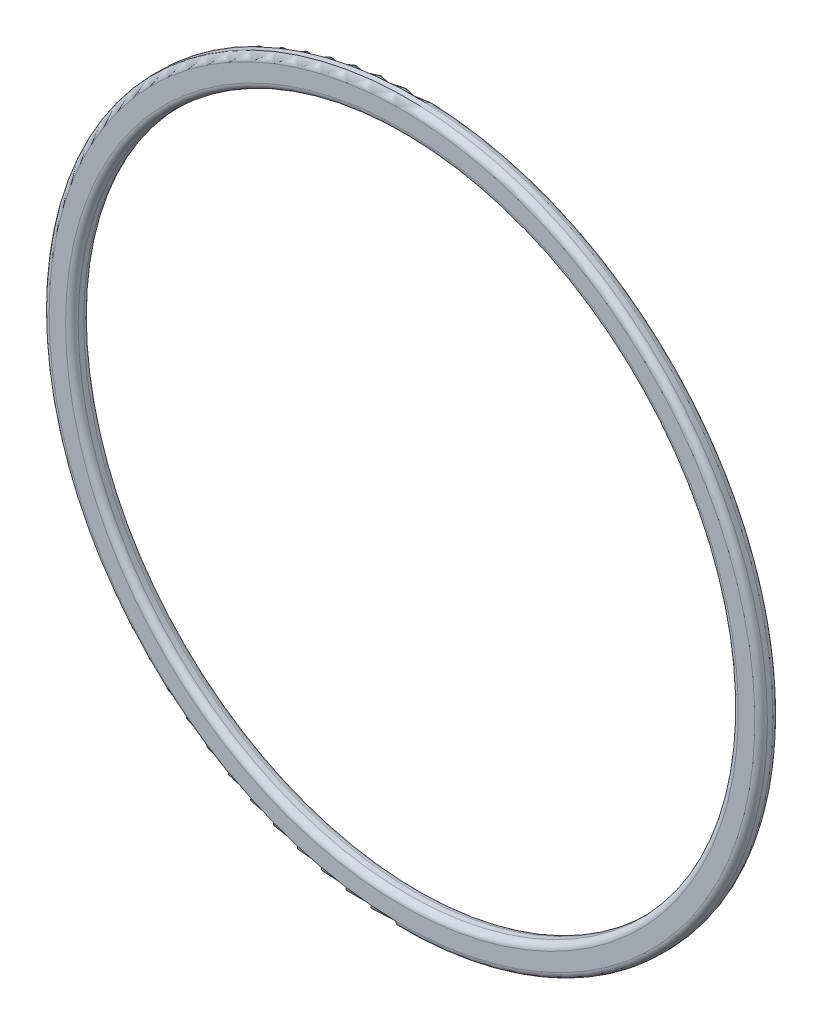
from build123d import *


with BuildPart() as part:
    # Balayage1: sweep along a path in Esquisse1
    with BuildLine(Plane.XY) as balayage1_path:
        CenterArc((0, 0), 22.375, 0, 360)
    # Esquisse2 → Balayage1 (sweep)
    with BuildSketch(Plane(origin=(0, 0, 0), x_dir=(1, 0, 0), z_dir=(0, 1, 0))):
        with BuildLine():
            Line((-22.45, 0.628488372), (-21.4, 0.628488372))
            ThreePointArc((-21.4, 0.628488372), (-21.117157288, 0.511331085), (-21, 0.228488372))
            Line((-21, 0.228488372), (-21, -0.121511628))
            ThreePointArc((-21, -0.121511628), (-21.117157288, -0.40435434), (-21.4, -0.521511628))
            Line((-21.4, -0.521511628), (-22.45, -0.521511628))
            ThreePointArc((-22.45, -0.521511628), (-22.732842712, -0.40435434), (-22.85, -0.121511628))
            Line((-22.85, -0.121511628), (-22.85, 0.228488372))
            ThreePointArc((-22.85, 0.228488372), (-22.732842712, 0.511331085), (-22.45, 0.628488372))
        make_face()
    sweep(path=balayage1_path.line)


solid = part.part
